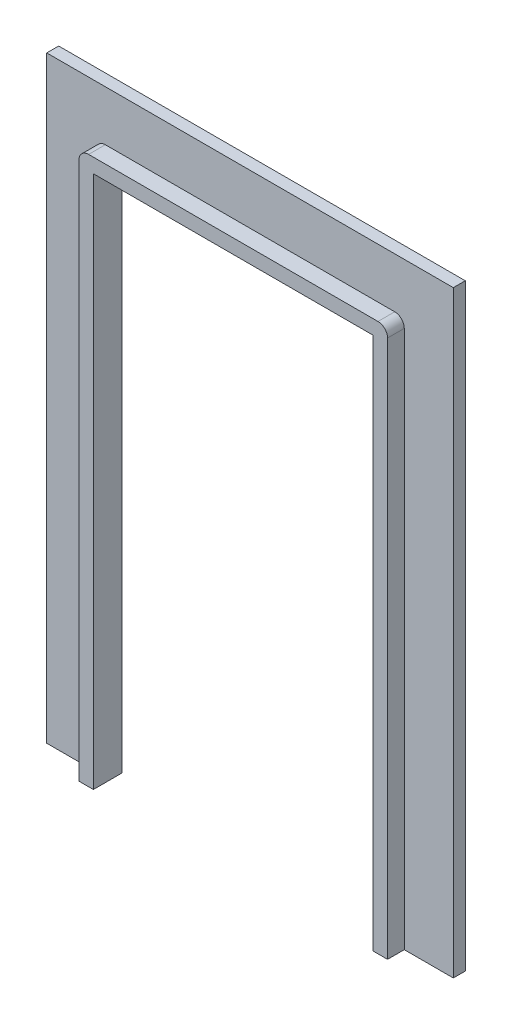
ISO-10303-21;
HEADER;
FILE_DESCRIPTION(('STEP AP214'),'2;1');
FILE_NAME('part.step','',(''),(''),'','','');
FILE_SCHEMA(('AUTOMOTIVE_DESIGN { 1 0 10303 214 1 1 1 1 }'));
ENDSEC;
DATA;
#1=APPLICATION_CONTEXT('core data for automotive mechanical design processes');
#2=APPLICATION_PROTOCOL_DEFINITION('international standard','automotive_design',2000,#1);
#3=PRODUCT_CONTEXT('',#1,'mechanical');
#4=PRODUCT('Part','Part','',(#3));
#5=PRODUCT_RELATED_PRODUCT_CATEGORY('part','',(#4));
#6=PRODUCT_DEFINITION_FORMATION('','',#4);
#7=PRODUCT_DEFINITION_CONTEXT('part definition',#1,'design');
#8=PRODUCT_DEFINITION('design','',#6,#7);
#9=PRODUCT_DEFINITION_SHAPE('','',#8);
#10=(LENGTH_UNIT() NAMED_UNIT(*) SI_UNIT(.MILLI.,.METRE.));
#11=(NAMED_UNIT(*) PLANE_ANGLE_UNIT() SI_UNIT($,.RADIAN.));
#12=(NAMED_UNIT(*) SI_UNIT($,.STERADIAN.) SOLID_ANGLE_UNIT());
#13=UNCERTAINTY_MEASURE_WITH_UNIT(LENGTH_MEASURE(1.E-05),#10,'distance_accuracy_value','');
#14=(GEOMETRIC_REPRESENTATION_CONTEXT(3) GLOBAL_UNCERTAINTY_ASSIGNED_CONTEXT((#13)) GLOBAL_UNIT_ASSIGNED_CONTEXT((#10,
#11,#12)) REPRESENTATION_CONTEXT('',''));
#15=CARTESIAN_POINT('',(0.,0.,0.));
#16=DIRECTION('',(0.,0.,1.));
#17=DIRECTION('',(1.,0.,0.));
#18=AXIS2_PLACEMENT_3D('',#15,#16,#17);
#19=CARTESIAN_POINT('',(0.,0.,6.));
#20=DIRECTION('',(0.,1.,0.));
#21=DIRECTION('',(0.,0.,1.));
#22=AXIS2_PLACEMENT_3D('',#19,#20,#21);
#23=PLANE('',#22);
#24=DIRECTION('',(1.,0.,0.));
#25=VECTOR('',#24,1.);
#26=CARTESIAN_POINT('',(0.,0.,0.));
#27=LINE('',#26,#25);
#28=CARTESIAN_POINT('',(0.,0.,0.));
#29=VERTEX_POINT('',#28);
#30=CARTESIAN_POINT('',(13.25,0.,0.));
#31=VERTEX_POINT('',#30);
#32=EDGE_CURVE('E145',#29,#31,#27,.T.);
#33=ORIENTED_EDGE('',*,*,#32,.T.);
#34=DIRECTION('',(0.,0.,1.));
#35=VECTOR('',#34,1.);
#36=CARTESIAN_POINT('',(13.25,0.,0.));
#37=LINE('',#36,#35);
#38=CARTESIAN_POINT('',(13.25,0.,6.));
#39=VERTEX_POINT('',#38);
#40=EDGE_CURVE('E130',#31,#39,#37,.T.);
#41=ORIENTED_EDGE('',*,*,#40,.T.);
#42=DIRECTION('',(1.,0.,0.));
#43=VECTOR('',#42,1.);
#44=CARTESIAN_POINT('',(0.,0.,6.));
#45=LINE('',#44,#43);
#46=CARTESIAN_POINT('',(10.25,0.,6.));
#47=VERTEX_POINT('',#46);
#48=EDGE_CURVE('E143',#47,#39,#45,.T.);
#49=ORIENTED_EDGE('',*,*,#48,.F.);
#50=DIRECTION('',(0.,0.,1.));
#51=VECTOR('',#50,1.);
#52=CARTESIAN_POINT('',(10.25,0.,2.5));
#53=LINE('',#52,#51);
#54=CARTESIAN_POINT('',(10.25,0.,2.5));
#55=VERTEX_POINT('',#54);
#56=EDGE_CURVE('E212',#55,#47,#53,.T.);
#57=ORIENTED_EDGE('',*,*,#56,.F.);
#58=DIRECTION('',(1.,0.,0.));
#59=VECTOR('',#58,1.);
#60=CARTESIAN_POINT('',(0.,0.,2.5));
#61=LINE('',#60,#59);
#62=CARTESIAN_POINT('',(0.,0.,2.5));
#63=VERTEX_POINT('',#62);
#64=EDGE_CURVE('E167',#63,#55,#61,.T.);
#65=ORIENTED_EDGE('',*,*,#64,.F.);
#66=DIRECTION('',(0.,0.,-1.));
#67=VECTOR('',#66,1.);
#68=CARTESIAN_POINT('',(0.,0.,6.));
#69=LINE('',#68,#67);
#70=EDGE_CURVE('E35',#63,#29,#69,.T.);
#71=ORIENTED_EDGE('',*,*,#70,.T.);
#72=EDGE_LOOP('',(#33,#41,#49,#57,#65,#71));
#73=FACE_BOUND('',#72,.T.);
#74=ADVANCED_FACE('F27',(#73),#23,.F.);
#75=CARTESIAN_POINT('',(0.,0.,6.));
#76=DIRECTION('',(1.,0.,0.));
#77=DIRECTION('',(0.,0.,-1.));
#78=AXIS2_PLACEMENT_3D('',#75,#76,#77);
#79=PLANE('',#78);
#80=DIRECTION('',(0.,-1.,0.));
#81=VECTOR('',#80,1.);
#82=CARTESIAN_POINT('',(0.,0.,2.5));
#83=LINE('',#82,#81);
#84=CARTESIAN_POINT('',(0.,125.,2.5));
#85=VERTEX_POINT('',#84);
#86=EDGE_CURVE('E183',#85,#63,#83,.T.);
#87=ORIENTED_EDGE('',*,*,#86,.F.);
#88=DIRECTION('',(0.,0.,-1.));
#89=VECTOR('',#88,1.);
#90=CARTESIAN_POINT('',(0.,125.,6.));
#91=LINE('',#90,#89);
#92=CARTESIAN_POINT('',(0.,125.,0.));
#93=VERTEX_POINT('',#92);
#94=EDGE_CURVE('E153',#85,#93,#91,.T.);
#95=ORIENTED_EDGE('',*,*,#94,.T.);
#96=DIRECTION('',(0.,-1.,0.));
#97=VECTOR('',#96,1.);
#98=CARTESIAN_POINT('',(0.,0.,0.));
#99=LINE('',#98,#97);
#100=EDGE_CURVE('E175',#93,#29,#99,.T.);
#101=ORIENTED_EDGE('',*,*,#100,.T.);
#102=ORIENTED_EDGE('',*,*,#70,.F.);
#103=EDGE_LOOP('',(#87,#95,#101,#102));
#104=FACE_BOUND('',#103,.T.);
#105=ADVANCED_FACE('F29',(#104),#79,.F.);
#106=CARTESIAN_POINT('',(71.75,0.,6.00000000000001));
#107=VERTEX_POINT('',#106);
#108=CARTESIAN_POINT('',(74.75,0.,6.00000000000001));
#109=VERTEX_POINT('',#108);
#110=EDGE_CURVE('E154',#107,#109,#45,.T.);
#111=ORIENTED_EDGE('',*,*,#110,.F.);
#112=DIRECTION('',(0.,0.,1.));
#113=VECTOR('',#112,1.);
#114=CARTESIAN_POINT('',(71.75,0.,0.));
#115=LINE('',#114,#113);
#116=CARTESIAN_POINT('',(71.75,0.,0.));
#117=VERTEX_POINT('',#116);
#118=EDGE_CURVE('E146',#117,#107,#115,.T.);
#119=ORIENTED_EDGE('',*,*,#118,.F.);
#120=CARTESIAN_POINT('',(85.,0.,0.));
#121=VERTEX_POINT('',#120);
#122=EDGE_CURVE('E178',#117,#121,#27,.T.);
#123=ORIENTED_EDGE('',*,*,#122,.T.);
#124=DIRECTION('',(0.,0.,-1.));
#125=VECTOR('',#124,1.);
#126=CARTESIAN_POINT('',(85.,0.,6.00000000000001));
#127=LINE('',#126,#125);
#128=CARTESIAN_POINT('',(85.,0.,2.5));
#129=VERTEX_POINT('',#128);
#130=EDGE_CURVE('E163',#129,#121,#127,.T.);
#131=ORIENTED_EDGE('',*,*,#130,.F.);
#132=CARTESIAN_POINT('',(74.75,0.,2.5));
#133=VERTEX_POINT('',#132);
#134=EDGE_CURVE('E185',#133,#129,#61,.T.);
#135=ORIENTED_EDGE('',*,*,#134,.F.);
#136=DIRECTION('',(0.,0.,1.));
#137=VECTOR('',#136,1.);
#138=CARTESIAN_POINT('',(74.75,0.,2.5));
#139=LINE('',#138,#137);
#140=EDGE_CURVE('E214',#133,#109,#139,.T.);
#141=ORIENTED_EDGE('',*,*,#140,.T.);
#142=EDGE_LOOP('',(#111,#119,#123,#131,#135,#141));
#143=FACE_BOUND('',#142,.T.);
#144=ADVANCED_FACE('F201',(#143),#23,.F.);
#145=CARTESIAN_POINT('',(85.,0.,6.00000000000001));
#146=DIRECTION('',(-1.,0.,0.));
#147=DIRECTION('',(0.,0.,1.));
#148=AXIS2_PLACEMENT_3D('',#145,#146,#147);
#149=PLANE('',#148);
#150=DIRECTION('',(0.,1.,0.));
#151=VECTOR('',#150,1.);
#152=CARTESIAN_POINT('',(85.,0.,2.5));
#153=LINE('',#152,#151);
#154=CARTESIAN_POINT('',(85.,125.,2.5));
#155=VERTEX_POINT('',#154);
#156=EDGE_CURVE('E205',#129,#155,#153,.T.);
#157=ORIENTED_EDGE('',*,*,#156,.F.);
#158=ORIENTED_EDGE('',*,*,#130,.T.);
#159=DIRECTION('',(0.,1.,0.));
#160=VECTOR('',#159,1.);
#161=CARTESIAN_POINT('',(85.,0.,0.));
#162=LINE('',#161,#160);
#163=CARTESIAN_POINT('',(85.,125.,0.));
#164=VERTEX_POINT('',#163);
#165=EDGE_CURVE('E177',#121,#164,#162,.T.);
#166=ORIENTED_EDGE('',*,*,#165,.T.);
#167=DIRECTION('',(0.,0.,-1.));
#168=VECTOR('',#167,1.);
#169=CARTESIAN_POINT('',(85.,125.,6.00000000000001));
#170=LINE('',#169,#168);
#171=EDGE_CURVE('E156',#155,#164,#170,.T.);
#172=ORIENTED_EDGE('',*,*,#171,.F.);
#173=EDGE_LOOP('',(#157,#158,#166,#172));
#174=FACE_BOUND('',#173,.T.);
#175=ADVANCED_FACE('F204',(#174),#149,.F.);
#176=CARTESIAN_POINT('',(0.,125.,6.));
#177=DIRECTION('',(0.,-1.,0.));
#178=DIRECTION('',(0.,0.,-1.));
#179=AXIS2_PLACEMENT_3D('',#176,#177,#178);
#180=PLANE('',#179);
#181=DIRECTION('',(-1.,0.,0.));
#182=VECTOR('',#181,1.);
#183=CARTESIAN_POINT('',(0.,125.,2.5));
#184=LINE('',#183,#182);
#185=EDGE_CURVE('E12',#155,#85,#184,.T.);
#186=ORIENTED_EDGE('',*,*,#185,.F.);
#187=ORIENTED_EDGE('',*,*,#171,.T.);
#188=DIRECTION('',(-1.,0.,0.));
#189=VECTOR('',#188,1.);
#190=CARTESIAN_POINT('',(0.,125.,0.));
#191=LINE('',#190,#189);
#192=EDGE_CURVE('E158',#164,#93,#191,.T.);
#193=ORIENTED_EDGE('',*,*,#192,.T.);
#194=ORIENTED_EDGE('',*,*,#94,.F.);
#195=EDGE_LOOP('',(#186,#187,#193,#194));
#196=FACE_BOUND('',#195,.T.);
#197=ADVANCED_FACE('F193',(#196),#180,.F.);
#198=CARTESIAN_POINT('',(0.,125.,6.));
#199=DIRECTION('',(0.,0.,-1.));
#200=DIRECTION('',(-1.,0.,0.));
#201=AXIS2_PLACEMENT_3D('',#198,#199,#200);
#202=PLANE('',#201);
#203=ORIENTED_EDGE('',*,*,#48,.T.);
#204=DIRECTION('',(0.,-1.,0.));
#205=VECTOR('',#204,1.);
#206=CARTESIAN_POINT('',(13.25,0.,6.));
#207=LINE('',#206,#205);
#208=CARTESIAN_POINT('',(13.25,111.5,6.));
#209=VERTEX_POINT('',#208);
#210=EDGE_CURVE('E126',#209,#39,#207,.T.);
#211=ORIENTED_EDGE('',*,*,#210,.F.);
#212=DIRECTION('',(-1.,0.,0.));
#213=VECTOR('',#212,1.);
#214=CARTESIAN_POINT('',(13.25,111.5,6.));
#215=LINE('',#214,#213);
#216=CARTESIAN_POINT('',(71.75,111.5,6.00000000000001));
#217=VERTEX_POINT('',#216);
#218=EDGE_CURVE('E254',#217,#209,#215,.T.);
#219=ORIENTED_EDGE('',*,*,#218,.F.);
#220=DIRECTION('',(0.,1.,0.));
#221=VECTOR('',#220,1.);
#222=CARTESIAN_POINT('',(71.75,0.,6.00000000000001));
#223=LINE('',#222,#221);
#224=EDGE_CURVE('E137',#107,#217,#223,.T.);
#225=ORIENTED_EDGE('',*,*,#224,.F.);
#226=ORIENTED_EDGE('',*,*,#110,.T.);
#227=DIRECTION('',(0.,1.,0.));
#228=VECTOR('',#227,1.);
#229=CARTESIAN_POINT('',(74.75,0.,6.00000000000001));
#230=LINE('',#229,#228);
#231=CARTESIAN_POINT('',(74.75,112.5,6.00000000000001));
#232=VERTEX_POINT('',#231);
#233=EDGE_CURVE('E243',#109,#232,#230,.T.);
#234=ORIENTED_EDGE('',*,*,#233,.T.);
#235=CARTESIAN_POINT('',(72.75,112.5,6.));
#236=DIRECTION('',(0.,0.,1.));
#237=DIRECTION('',(-1.,0.,0.));
#238=AXIS2_PLACEMENT_3D('',#235,#236,#237);
#239=CIRCLE('',#238,2.);
#240=CARTESIAN_POINT('',(72.75,114.5,6.00000000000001));
#241=VERTEX_POINT('',#240);
#242=EDGE_CURVE('E50',#232,#241,#239,.T.);
#243=ORIENTED_EDGE('',*,*,#242,.T.);
#244=DIRECTION('',(-1.,0.,0.));
#245=VECTOR('',#244,1.);
#246=CARTESIAN_POINT('',(12.25,114.5,6.00000000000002));
#247=LINE('',#246,#245);
#248=CARTESIAN_POINT('',(12.25,114.5,6.00000000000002));
#249=VERTEX_POINT('',#248);
#250=EDGE_CURVE('E239',#241,#249,#247,.T.);
#251=ORIENTED_EDGE('',*,*,#250,.T.);
#252=CARTESIAN_POINT('',(12.25,112.5,6.00000000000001));
#253=DIRECTION('',(0.,0.,1.));
#254=DIRECTION('',(-1.,0.,0.));
#255=AXIS2_PLACEMENT_3D('',#252,#253,#254);
#256=CIRCLE('',#255,2.);
#257=CARTESIAN_POINT('',(10.25,112.5,6.));
#258=VERTEX_POINT('',#257);
#259=EDGE_CURVE('E237',#249,#258,#256,.T.);
#260=ORIENTED_EDGE('',*,*,#259,.T.);
#261=DIRECTION('',(0.,-1.,0.));
#262=VECTOR('',#261,1.);
#263=CARTESIAN_POINT('',(10.25,0.,6.));
#264=LINE('',#263,#262);
#265=EDGE_CURVE('E152',#258,#47,#264,.T.);
#266=ORIENTED_EDGE('',*,*,#265,.T.);
#267=EDGE_LOOP('',(#203,#211,#219,#225,#226,#234,#243,#251,#260,#266));
#268=FACE_BOUND('',#267,.T.);
#269=ADVANCED_FACE('F149',(#268),#202,.F.);
#270=CARTESIAN_POINT('',(0.,125.,0.));
#271=DIRECTION('',(0.,0.,-1.));
#272=DIRECTION('',(-1.,0.,0.));
#273=AXIS2_PLACEMENT_3D('',#270,#271,#272);
#274=PLANE('',#273);
#275=DIRECTION('',(0.,-1.,0.));
#276=VECTOR('',#275,1.);
#277=CARTESIAN_POINT('',(13.25,0.,0.));
#278=LINE('',#277,#276);
#279=CARTESIAN_POINT('',(13.25,111.5,0.));
#280=VERTEX_POINT('',#279);
#281=EDGE_CURVE('E176',#280,#31,#278,.T.);
#282=ORIENTED_EDGE('',*,*,#281,.T.);
#283=ORIENTED_EDGE('',*,*,#32,.F.);
#284=ORIENTED_EDGE('',*,*,#100,.F.);
#285=ORIENTED_EDGE('',*,*,#192,.F.);
#286=ORIENTED_EDGE('',*,*,#165,.F.);
#287=ORIENTED_EDGE('',*,*,#122,.F.);
#288=DIRECTION('',(0.,1.,0.));
#289=VECTOR('',#288,1.);
#290=CARTESIAN_POINT('',(71.75,0.,0.));
#291=LINE('',#290,#289);
#292=CARTESIAN_POINT('',(71.75,111.5,0.));
#293=VERTEX_POINT('',#292);
#294=EDGE_CURVE('E196',#117,#293,#291,.T.);
#295=ORIENTED_EDGE('',*,*,#294,.T.);
#296=DIRECTION('',(-1.,0.,0.));
#297=VECTOR('',#296,1.);
#298=CARTESIAN_POINT('',(13.25,111.5,0.));
#299=LINE('',#298,#297);
#300=EDGE_CURVE('E42',#293,#280,#299,.T.);
#301=ORIENTED_EDGE('',*,*,#300,.T.);
#302=EDGE_LOOP('',(#282,#283,#284,#285,#286,#287,#295,#301));
#303=FACE_BOUND('',#302,.T.);
#304=ADVANCED_FACE('F173',(#303),#274,.T.);
#305=CARTESIAN_POINT('',(42.5,62.5,2.5));
#306=DIRECTION('',(0.,0.,1.));
#307=DIRECTION('',(1.,0.,0.));
#308=AXIS2_PLACEMENT_3D('',#305,#306,#307);
#309=PLANE('',#308);
#310=ORIENTED_EDGE('',*,*,#64,.T.);
#311=DIRECTION('',(0.,-1.,0.));
#312=VECTOR('',#311,1.);
#313=CARTESIAN_POINT('',(10.25,0.,2.5));
#314=LINE('',#313,#312);
#315=CARTESIAN_POINT('',(10.25,112.5,2.5));
#316=VERTEX_POINT('',#315);
#317=EDGE_CURVE('E234',#316,#55,#314,.T.);
#318=ORIENTED_EDGE('',*,*,#317,.F.);
#319=CARTESIAN_POINT('',(12.25,112.5,2.50000000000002));
#320=DIRECTION('',(0.,0.,1.));
#321=DIRECTION('',(-1.,0.,0.));
#322=AXIS2_PLACEMENT_3D('',#319,#320,#321);
#323=CIRCLE('',#322,2.);
#324=CARTESIAN_POINT('',(12.25,114.5,2.5));
#325=VERTEX_POINT('',#324);
#326=EDGE_CURVE('E215',#325,#316,#323,.T.);
#327=ORIENTED_EDGE('',*,*,#326,.F.);
#328=DIRECTION('',(-1.,0.,0.));
#329=VECTOR('',#328,1.);
#330=CARTESIAN_POINT('',(12.25,114.5,2.5));
#331=LINE('',#330,#329);
#332=CARTESIAN_POINT('',(72.75,114.5,2.5));
#333=VERTEX_POINT('',#332);
#334=EDGE_CURVE('E225',#333,#325,#331,.T.);
#335=ORIENTED_EDGE('',*,*,#334,.F.);
#336=CARTESIAN_POINT('',(72.75,112.5,2.50000000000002));
#337=DIRECTION('',(0.,0.,1.));
#338=DIRECTION('',(-1.,0.,0.));
#339=AXIS2_PLACEMENT_3D('',#336,#337,#338);
#340=CIRCLE('',#339,2.);
#341=CARTESIAN_POINT('',(74.75,112.5,2.5));
#342=VERTEX_POINT('',#341);
#343=EDGE_CURVE('E228',#342,#333,#340,.T.);
#344=ORIENTED_EDGE('',*,*,#343,.F.);
#345=DIRECTION('',(0.,1.,0.));
#346=VECTOR('',#345,1.);
#347=CARTESIAN_POINT('',(74.75,0.,2.5));
#348=LINE('',#347,#346);
#349=EDGE_CURVE('E231',#133,#342,#348,.T.);
#350=ORIENTED_EDGE('',*,*,#349,.F.);
#351=ORIENTED_EDGE('',*,*,#134,.T.);
#352=ORIENTED_EDGE('',*,*,#156,.T.);
#353=ORIENTED_EDGE('',*,*,#185,.T.);
#354=ORIENTED_EDGE('',*,*,#86,.T.);
#355=EDGE_LOOP('',(#310,#318,#327,#335,#344,#350,#351,#352,#353,#354));
#356=FACE_BOUND('',#355,.T.);
#357=ADVANCED_FACE('F288',(#356),#309,.T.);
#358=CARTESIAN_POINT('',(10.25,0.,2.5));
#359=DIRECTION('',(-1.,0.,0.));
#360=DIRECTION('',(0.,-1.,0.));
#361=AXIS2_PLACEMENT_3D('',#358,#359,#360);
#362=PLANE('',#361);
#363=ORIENTED_EDGE('',*,*,#265,.F.);
#364=DIRECTION('',(0.,0.,1.));
#365=VECTOR('',#364,1.);
#366=CARTESIAN_POINT('',(10.25,112.5,2.5));
#367=LINE('',#366,#365);
#368=EDGE_CURVE('E207',#316,#258,#367,.T.);
#369=ORIENTED_EDGE('',*,*,#368,.F.);
#370=ORIENTED_EDGE('',*,*,#317,.T.);
#371=ORIENTED_EDGE('',*,*,#56,.T.);
#372=EDGE_LOOP('',(#363,#369,#370,#371));
#373=FACE_BOUND('',#372,.T.);
#374=ADVANCED_FACE('F291',(#373),#362,.T.);
#375=CARTESIAN_POINT('',(12.25,112.5,2.50000000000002));
#376=DIRECTION('',(0.,0.,1.));
#377=DIRECTION('',(1.,0.,0.));
#378=AXIS2_PLACEMENT_3D('',#375,#376,#377);
#379=CYLINDRICAL_SURFACE('',#378,2.);
#380=ORIENTED_EDGE('',*,*,#259,.F.);
#381=DIRECTION('',(0.,0.,1.));
#382=VECTOR('',#381,1.);
#383=CARTESIAN_POINT('',(12.25,114.5,2.5));
#384=LINE('',#383,#382);
#385=EDGE_CURVE('E209',#325,#249,#384,.T.);
#386=ORIENTED_EDGE('',*,*,#385,.F.);
#387=ORIENTED_EDGE('',*,*,#326,.T.);
#388=ORIENTED_EDGE('',*,*,#368,.T.);
#389=EDGE_LOOP('',(#380,#386,#387,#388));
#390=FACE_BOUND('',#389,.T.);
#391=ADVANCED_FACE('F294',(#390),#379,.T.);
#392=CARTESIAN_POINT('',(12.25,114.5,2.5));
#393=DIRECTION('',(0.,1.,0.));
#394=DIRECTION('',(-1.,0.,0.));
#395=AXIS2_PLACEMENT_3D('',#392,#393,#394);
#396=PLANE('',#395);
#397=ORIENTED_EDGE('',*,*,#250,.F.);
#398=DIRECTION('',(0.,0.,1.));
#399=VECTOR('',#398,1.);
#400=CARTESIAN_POINT('',(72.75,114.5,2.5));
#401=LINE('',#400,#399);
#402=EDGE_CURVE('E220',#333,#241,#401,.T.);
#403=ORIENTED_EDGE('',*,*,#402,.F.);
#404=ORIENTED_EDGE('',*,*,#334,.T.);
#405=ORIENTED_EDGE('',*,*,#385,.T.);
#406=EDGE_LOOP('',(#397,#403,#404,#405));
#407=FACE_BOUND('',#406,.T.);
#408=ADVANCED_FACE('F302',(#407),#396,.T.);
#409=CARTESIAN_POINT('',(72.75,112.5,2.50000000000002));
#410=DIRECTION('',(0.,0.,1.));
#411=DIRECTION('',(1.,0.,0.));
#412=AXIS2_PLACEMENT_3D('',#409,#410,#411);
#413=CYLINDRICAL_SURFACE('',#412,2.);
#414=ORIENTED_EDGE('',*,*,#242,.F.);
#415=DIRECTION('',(0.,0.,1.));
#416=VECTOR('',#415,1.);
#417=CARTESIAN_POINT('',(74.75,112.5,2.5));
#418=LINE('',#417,#416);
#419=EDGE_CURVE('E218',#342,#232,#418,.T.);
#420=ORIENTED_EDGE('',*,*,#419,.F.);
#421=ORIENTED_EDGE('',*,*,#343,.T.);
#422=ORIENTED_EDGE('',*,*,#402,.T.);
#423=EDGE_LOOP('',(#414,#420,#421,#422));
#424=FACE_BOUND('',#423,.T.);
#425=ADVANCED_FACE('F298',(#424),#413,.T.);
#426=CARTESIAN_POINT('',(74.75,0.,2.5));
#427=DIRECTION('',(1.,0.,0.));
#428=DIRECTION('',(0.,0.,-1.));
#429=AXIS2_PLACEMENT_3D('',#426,#427,#428);
#430=PLANE('',#429);
#431=ORIENTED_EDGE('',*,*,#233,.F.);
#432=ORIENTED_EDGE('',*,*,#140,.F.);
#433=ORIENTED_EDGE('',*,*,#349,.T.);
#434=ORIENTED_EDGE('',*,*,#419,.T.);
#435=EDGE_LOOP('',(#431,#432,#433,#434));
#436=FACE_BOUND('',#435,.T.);
#437=ADVANCED_FACE('F268',(#436),#430,.T.);
#438=CARTESIAN_POINT('',(13.25,0.,0.));
#439=DIRECTION('',(-1.,0.,0.));
#440=DIRECTION('',(0.,0.,1.));
#441=AXIS2_PLACEMENT_3D('',#438,#439,#440);
#442=PLANE('',#441);
#443=ORIENTED_EDGE('',*,*,#210,.T.);
#444=ORIENTED_EDGE('',*,*,#40,.F.);
#445=ORIENTED_EDGE('',*,*,#281,.F.);
#446=DIRECTION('',(0.,0.,1.));
#447=VECTOR('',#446,1.);
#448=CARTESIAN_POINT('',(13.25,111.5,0.));
#449=LINE('',#448,#447);
#450=EDGE_CURVE('E132',#280,#209,#449,.T.);
#451=ORIENTED_EDGE('',*,*,#450,.T.);
#452=EDGE_LOOP('',(#443,#444,#445,#451));
#453=FACE_BOUND('',#452,.T.);
#454=ADVANCED_FACE('F128',(#453),#442,.F.);
#455=CARTESIAN_POINT('',(13.25,111.5,0.));
#456=DIRECTION('',(0.,1.,0.));
#457=DIRECTION('',(-1.,0.,0.));
#458=AXIS2_PLACEMENT_3D('',#455,#456,#457);
#459=PLANE('',#458);
#460=ORIENTED_EDGE('',*,*,#218,.T.);
#461=ORIENTED_EDGE('',*,*,#450,.F.);
#462=ORIENTED_EDGE('',*,*,#300,.F.);
#463=DIRECTION('',(0.,0.,1.));
#464=VECTOR('',#463,1.);
#465=CARTESIAN_POINT('',(71.75,111.5,0.));
#466=LINE('',#465,#464);
#467=EDGE_CURVE('E248',#293,#217,#466,.T.);
#468=ORIENTED_EDGE('',*,*,#467,.T.);
#469=EDGE_LOOP('',(#460,#461,#462,#468));
#470=FACE_BOUND('',#469,.T.);
#471=ADVANCED_FACE('F260',(#470),#459,.F.);
#472=CARTESIAN_POINT('',(71.75,0.,0.));
#473=DIRECTION('',(1.,0.,0.));
#474=DIRECTION('',(0.,1.,0.));
#475=AXIS2_PLACEMENT_3D('',#472,#473,#474);
#476=PLANE('',#475);
#477=ORIENTED_EDGE('',*,*,#224,.T.);
#478=ORIENTED_EDGE('',*,*,#467,.F.);
#479=ORIENTED_EDGE('',*,*,#294,.F.);
#480=ORIENTED_EDGE('',*,*,#118,.T.);
#481=EDGE_LOOP('',(#477,#478,#479,#480));
#482=FACE_BOUND('',#481,.T.);
#483=ADVANCED_FACE('F259',(#482),#476,.F.);
#484=CLOSED_SHELL('',(#74,#105,#144,#175,#197,#269,#304,#357,#374,#391,#408,#425,#437,#454,#471,#483));
#485=MANIFOLD_SOLID_BREP('B2',#484);
#486=ADVANCED_BREP_SHAPE_REPRESENTATION('',(#18,#485),#14);
#487=SHAPE_DEFINITION_REPRESENTATION(#9,#486);
ENDSEC;
END-ISO-10303-21;
